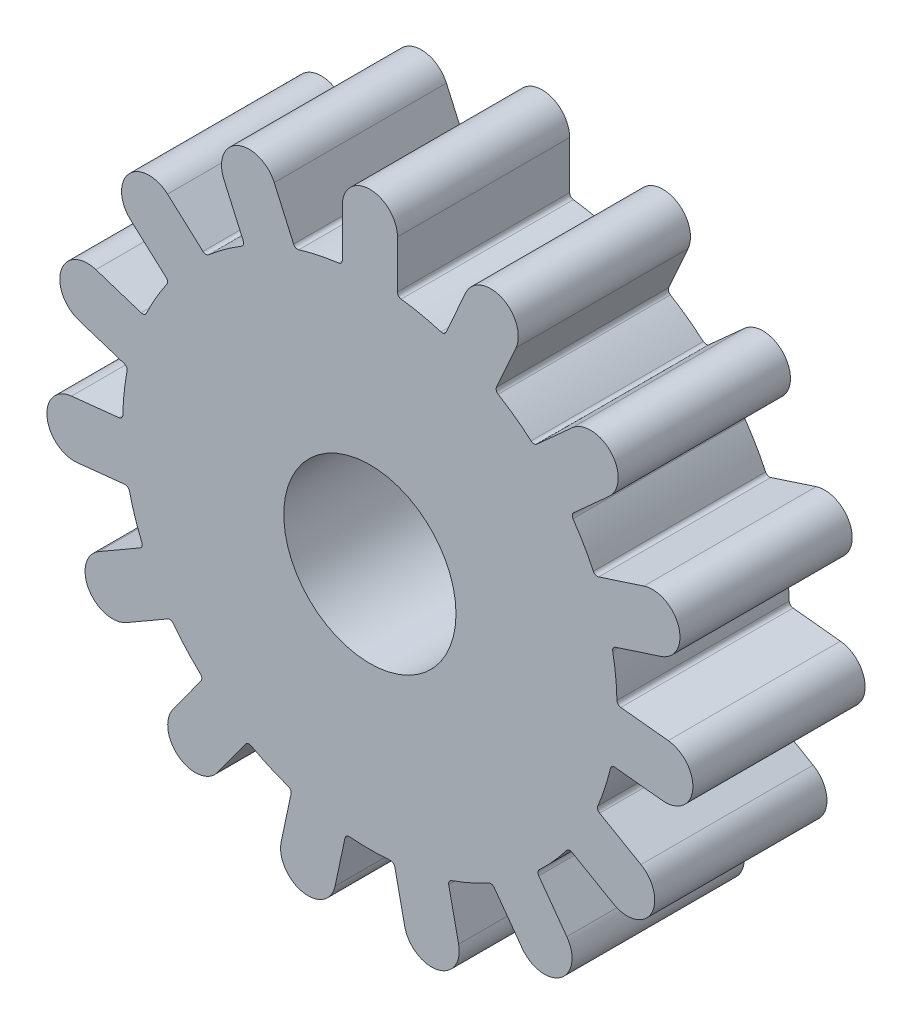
from build123d import *

# Parameters (mm, degrees)
SKETCH1_R           = 5
BOSS_EXTRUDE1_DEPTH = 10


with BuildPart() as part:
    # Sketch1 → Boss-Extrude1 (new body)
    with BuildSketch(Plane.XY):
        with BuildLine():
            Line((-1.6, 17.25), (-1.6, 14.482316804))
            ThreePointArc((-1.6, 14.482316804), (-1.66235736, 14.317119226), (-1.818321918, 14.234331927))
            ThreePointArc((-1.818321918, 14.234331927), (-2.983532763, 14.036418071), (-4.128504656, 13.743287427))
            ThreePointArc((-4.128504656, 13.743287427), (-4.304657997, 13.755480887), (-4.428816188, 13.881033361))
            Line((-4.428816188, 13.881033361), (-5.554534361, 16.409437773))
            ThreePointArc((-5.554534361, 16.409437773), (-7.666985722, 17.220331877), (-8.477879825, 15.107880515))
            Line((-8.477879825, 15.107880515), (-7.352161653, 12.579476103))
            ThreePointArc((-7.352161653, 12.579476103), (-7.341936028, 12.403197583), (-7.450744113, 12.264131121))
            ThreePointArc((-7.450744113, 12.264131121), (-8.43471837, 11.609393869), (-9.361475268, 10.875903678))
            ThreePointArc((-9.361475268, 10.875903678), (-9.52735888, 10.815394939), (-9.691849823, 10.879593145))
            Line((-9.691849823, 10.879593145), (-11.748639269, 12.73153468))
            ThreePointArc((-11.748639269, 12.73153468), (-14.00827996, 12.61311193), (-13.88985721, 10.353471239))
            Line((-13.88985721, 10.353471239), (-11.833067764, 8.501529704))
            ThreePointArc((-11.833067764, 8.501529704), (-11.752027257, 8.344650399), (-11.794864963, 8.173350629))
            ThreePointArc((-11.794864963, 8.173350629), (-12.427464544, 7.175), (-12.97576176, 6.127977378))
            ThreePointArc((-12.97576176, 6.127977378), (-13.102692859, 6.005228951), (-13.279074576, 5.996972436))
            Line((-13.279074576, 5.996972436), (-15.911297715, 6.852233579))
            ThreePointArc((-15.911297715, 6.852233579), (-17.927415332, 5.824970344), (-16.900152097, 3.808852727))
            Line((-16.900152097, 3.808852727), (-14.267928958, 2.953591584))
            ThreePointArc((-14.267928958, 2.953591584), (-14.130086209, 2.843237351), (-14.099546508, 2.66932356))
            ThreePointArc((-14.099546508, 2.66932356), (-14.271389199, 1.499983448), (-14.346421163, 0.320468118))
            ThreePointArc((-14.346421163, 0.320468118), (-14.412452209, 0.156704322), (-14.570226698, 0.077420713))
            Line((-14.570226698, 0.077420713), (-17.322748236, -0.211880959))
            ThreePointArc((-17.322748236, -0.211880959), (-18.746737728, -1.970361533), (-16.988257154, -3.394351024))
            Line((-16.988257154, -3.394351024), (-14.235735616, -3.105049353))
            ThreePointArc((-14.235735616, -3.105049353), (-14.064924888, -3.149797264), (-13.966288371, -3.296253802))
            ThreePointArc((-13.966288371, -3.296253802), (-13.647661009, -4.434393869), (-13.236454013, -5.54245299))
            ThreePointArc((-13.236454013, -5.54245299), (-13.230167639, -5.718915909), (-13.342054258, -5.855517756))
            Line((-13.342054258, -5.855517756), (-15.738938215, -7.239359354))
            ThreePointArc((-15.738938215, -7.239359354), (-16.324578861, -9.425), (-14.138938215, -10.010640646))
            Line((-14.138938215, -10.010640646), (-11.742054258, -8.626799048))
            ThreePointArc((-11.742054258, -8.626799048), (-11.567810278, -8.598203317), (-11.418132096, -8.691878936))
            ThreePointArc((-11.418132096, -8.691878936), (-10.664128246, -9.602024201), (-9.837783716, -10.447033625))
            ThreePointArc((-9.837783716, -10.447033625), (-9.760266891, -10.605683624), (-9.806919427, -10.775984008))
            Line((-9.806919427, -10.775984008), (-11.433722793, -13.015086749))
            ThreePointArc((-11.433722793, -13.015086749), (-11.079752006, -15.249970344), (-8.844868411, -14.895999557))
            Line((-8.844868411, -14.895999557), (-7.218065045, -12.656896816))
            ThreePointArc((-7.218065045, -12.656896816), (-7.070516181, -12.559901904), (-6.89567705, -12.58459924))
            ThreePointArc((-6.89567705, -12.58459924), (-5.836670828, -13.109377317), (-4.73807124, -13.545227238))
            ThreePointArc((-4.73807124, -13.545227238), (-4.602727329, -13.658632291), (-4.576079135, -13.833184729))
            Line((-4.576079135, -13.833184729), (-5.151512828, -16.540387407))
            ThreePointArc((-5.151512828, -16.540387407), (-3.919135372, -18.438082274), (-2.021440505, -17.205704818))
            Line((-2.021440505, -17.205704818), (-1.446006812, -14.49850214))
            ThreePointArc((-1.446006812, -14.49850214), (-1.350665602, -14.34987935), (-1.180896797, -14.301328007))
            ThreePointArc((-1.180896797, -14.301328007), (0, -14.35), (1.180896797, -14.301328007))
            ThreePointArc((1.180896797, -14.301328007), (1.350665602, -14.34987935), (1.446006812, -14.49850214))
            Line((1.446006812, -14.49850214), (2.021440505, -17.205704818))
            ThreePointArc((2.021440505, -17.205704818), (3.919135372, -18.438082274), (5.151512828, -16.540387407))
            Line((5.151512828, -16.540387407), (4.576079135, -13.833184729))
            ThreePointArc((4.576079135, -13.833184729), (4.602727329, -13.658632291), (4.73807124, -13.545227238))
            ThreePointArc((4.73807124, -13.545227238), (5.836670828, -13.109377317), (6.89567705, -12.58459924))
            ThreePointArc((6.89567705, -12.58459924), (7.070516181, -12.559901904), (7.218065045, -12.656896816))
            Line((7.218065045, -12.656896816), (8.844868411, -14.895999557))
            ThreePointArc((8.844868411, -14.895999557), (11.079752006, -15.249970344), (11.433722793, -13.015086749))
            Line((11.433722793, -13.015086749), (9.806919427, -10.775984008))
            ThreePointArc((9.806919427, -10.775984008), (9.760266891, -10.605683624), (9.837783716, -10.447033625))
            ThreePointArc((9.837783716, -10.447033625), (10.664128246, -9.602024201), (11.418132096, -8.691878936))
            ThreePointArc((11.418132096, -8.691878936), (11.567810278, -8.598203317), (11.742054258, -8.626799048))
            Line((11.742054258, -8.626799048), (14.138938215, -10.010640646))
            ThreePointArc((14.138938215, -10.010640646), (16.324578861, -9.425), (15.738938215, -7.239359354))
            Line((15.738938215, -7.239359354), (13.342054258, -5.855517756))
            ThreePointArc((13.342054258, -5.855517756), (13.230167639, -5.718915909), (13.236454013, -5.54245299))
            ThreePointArc((13.236454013, -5.54245299), (13.647661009, -4.434393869), (13.966288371, -3.296253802))
            ThreePointArc((13.966288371, -3.296253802), (14.064924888, -3.149797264), (14.235735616, -3.105049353))
            Line((14.235735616, -3.105049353), (16.988257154, -3.394351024))
            ThreePointArc((16.988257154, -3.394351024), (18.746737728, -1.970361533), (17.322748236, -0.211880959))
            Line((17.322748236, -0.211880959), (14.570226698, 0.077420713))
            ThreePointArc((14.570226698, 0.077420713), (14.412452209, 0.156704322), (14.346421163, 0.320468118))
            ThreePointArc((14.346421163, 0.320468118), (14.271389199, 1.499983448), (14.099546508, 2.66932356))
            ThreePointArc((14.099546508, 2.66932356), (14.130086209, 2.843237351), (14.267928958, 2.953591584))
            Line((14.267928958, 2.953591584), (16.900152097, 3.808852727))
            ThreePointArc((16.900152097, 3.808852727), (17.927415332, 5.824970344), (15.911297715, 6.852233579))
            Line((15.911297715, 6.852233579), (13.279074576, 5.996972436))
            ThreePointArc((13.279074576, 5.996972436), (13.102692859, 6.005228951), (12.97576176, 6.127977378))
            ThreePointArc((12.97576176, 6.127977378), (12.427464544, 7.175), (11.794864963, 8.173350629))
            ThreePointArc((11.794864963, 8.173350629), (11.752027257, 8.344650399), (11.833067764, 8.501529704))
            Line((11.833067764, 8.501529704), (13.88985721, 10.353471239))
            ThreePointArc((13.88985721, 10.353471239), (14.00827996, 12.61311193), (11.748639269, 12.73153468))
            Line((11.748639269, 12.73153468), (9.691849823, 10.879593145))
            ThreePointArc((9.691849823, 10.879593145), (9.52735888, 10.815394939), (9.361475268, 10.875903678))
            ThreePointArc((9.361475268, 10.875903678), (8.43471837, 11.609393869), (7.450744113, 12.264131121))
            ThreePointArc((7.450744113, 12.264131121), (7.341936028, 12.403197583), (7.352161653, 12.579476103))
            Line((7.352161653, 12.579476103), (8.477879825, 15.107880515))
            ThreePointArc((8.477879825, 15.107880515), (7.666985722, 17.220331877), (5.554534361, 16.409437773))
            Line((5.554534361, 16.409437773), (4.428816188, 13.881033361))
            ThreePointArc((4.428816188, 13.881033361), (4.304657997, 13.755480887), (4.128504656, 13.743287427))
            ThreePointArc((4.128504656, 13.743287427), (2.983532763, 14.036418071), (1.818321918, 14.234331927))
            ThreePointArc((1.818321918, 14.234331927), (1.66235736, 14.317119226), (1.6, 14.482316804))
            Line((1.6, 14.482316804), (1.6, 17.25))
            ThreePointArc((1.6, 17.25), (0, 18.85), (-1.6, 17.25))
        make_face()
        Circle(SKETCH1_R, mode=Mode.SUBTRACT)
    extrude(amount=BOSS_EXTRUDE1_DEPTH)


solid = part.part
